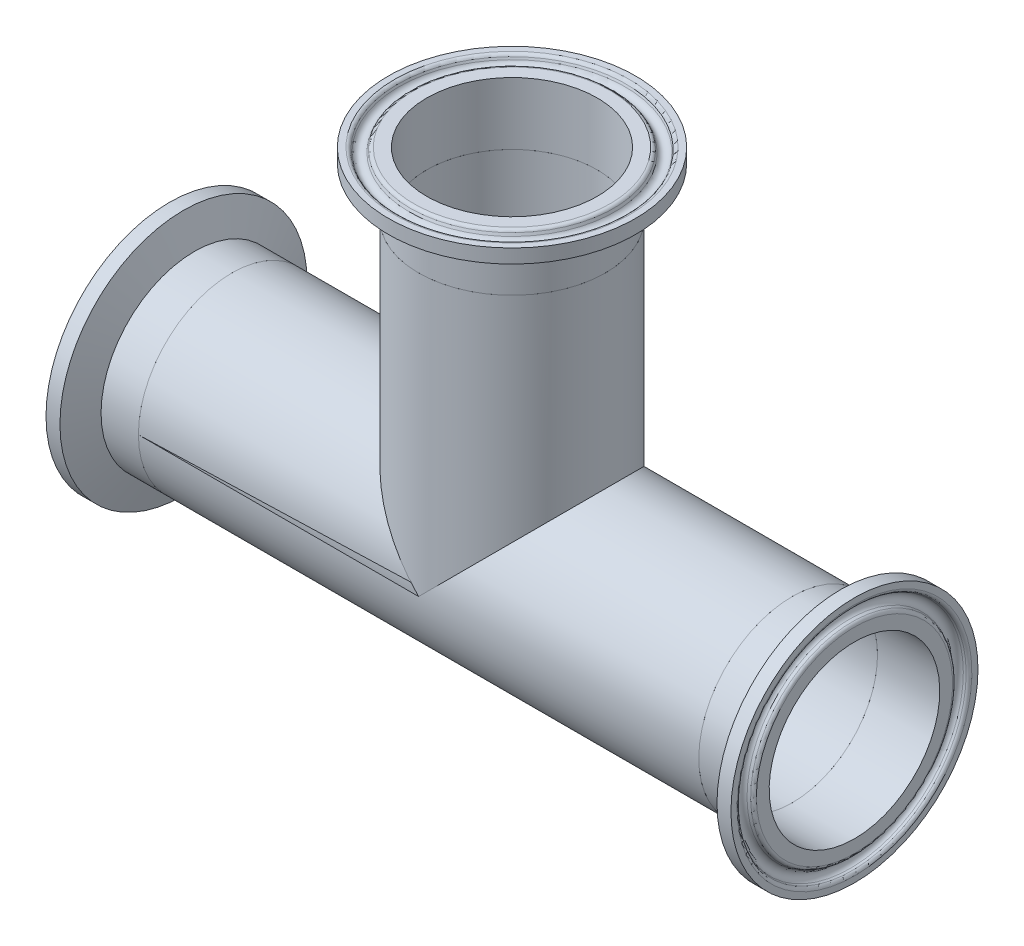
ISO-10303-21;
HEADER;
FILE_DESCRIPTION(('STEP AP214'),'2;1');
FILE_NAME('part.step','',(''),(''),'','','');
FILE_SCHEMA(('AUTOMOTIVE_DESIGN { 1 0 10303 214 1 1 1 1 }'));
ENDSEC;
DATA;
#1=APPLICATION_CONTEXT('core data for automotive mechanical design processes');
#2=APPLICATION_PROTOCOL_DEFINITION('international standard','automotive_design',2000,#1);
#3=PRODUCT_CONTEXT('',#1,'mechanical');
#4=PRODUCT('Part','Part','',(#3));
#5=PRODUCT_RELATED_PRODUCT_CATEGORY('part','',(#4));
#6=PRODUCT_DEFINITION_FORMATION('','',#4);
#7=PRODUCT_DEFINITION_CONTEXT('part definition',#1,'design');
#8=PRODUCT_DEFINITION('design','',#6,#7);
#9=PRODUCT_DEFINITION_SHAPE('','',#8);
#10=(LENGTH_UNIT() NAMED_UNIT(*) SI_UNIT(.MILLI.,.METRE.));
#11=(NAMED_UNIT(*) PLANE_ANGLE_UNIT() SI_UNIT($,.RADIAN.));
#12=(NAMED_UNIT(*) SI_UNIT($,.STERADIAN.) SOLID_ANGLE_UNIT());
#13=UNCERTAINTY_MEASURE_WITH_UNIT(LENGTH_MEASURE(1.E-05),#10,'distance_accuracy_value','');
#14=(GEOMETRIC_REPRESENTATION_CONTEXT(3) GLOBAL_UNCERTAINTY_ASSIGNED_CONTEXT((#13)) GLOBAL_UNIT_ASSIGNED_CONTEXT((#10,
#11,#12)) REPRESENTATION_CONTEXT('',''));
#15=CARTESIAN_POINT('',(0.,0.,0.));
#16=DIRECTION('',(0.,0.,1.));
#17=DIRECTION('',(1.,0.,0.));
#18=AXIS2_PLACEMENT_3D('',#15,#16,#17);
#19=CARTESIAN_POINT('',(56.5172049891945,119.74462668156,86.3832546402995));
#20=DIRECTION('',(0.,-1.00000000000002,0.));
#21=DIRECTION('',(0.552443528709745,0.,0.833550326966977));
#22=AXIS2_PLACEMENT_3D('',#19,#20,#21);
#23=CONICAL_SURFACE('',#22,20.9336326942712,0.401425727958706);
#24=CARTESIAN_POINT('',(56.5172049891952,120.264362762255,86.3832546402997));
#25=DIRECTION('',(0.,1.00000000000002,0.));
#26=DIRECTION('',(-0.552443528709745,0.,-0.833550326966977));
#27=AXIS2_PLACEMENT_3D('',#24,#25,#26);
#28=CIRCLE('',#27,20.7130178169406);
#29=CARTESIAN_POINT('',(45.0744323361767,120.264362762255,69.117911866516));
#30=VERTEX_POINT('',#29);
#31=EDGE_CURVE('P0_E9',#30,#30,#28,.T.);
#32=ORIENTED_EDGE('',*,*,#31,.F.);
#33=EDGE_LOOP('',(#32));
#34=FACE_BOUND('',#33,.T.);
#35=CARTESIAN_POINT('',(56.5172049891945,119.74462668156,86.3832546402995));
#36=DIRECTION('',(0.,1.00000000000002,0.));
#37=DIRECTION('',(-0.552443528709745,0.,-0.833550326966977));
#38=AXIS2_PLACEMENT_3D('',#35,#36,#37);
#39=CIRCLE('',#38,20.9336326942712);
#40=CARTESIAN_POINT('',(44.9525550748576,119.74462668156,68.9340182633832));
#41=VERTEX_POINT('',#40);
#42=EDGE_CURVE('P0_E54',#41,#41,#39,.T.);
#43=ORIENTED_EDGE('',*,*,#42,.T.);
#44=EDGE_LOOP('',(#43));
#45=FACE_BOUND('',#44,.T.);
#46=ADVANCED_FACE('P0_F14',(#34,#45),#23,.T.);
#47=CARTESIAN_POINT('',(56.5172049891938,119.966625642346,86.3832546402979));
#48=DIRECTION('',(0.,1.00000000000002,0.));
#49=DIRECTION('',(-0.552443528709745,0.,-0.833550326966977));
#50=AXIS2_PLACEMENT_3D('',#47,#48,#49);
#51=TOROIDAL_SURFACE('',#50,20.0115931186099,0.761999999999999);
#52=CARTESIAN_POINT('',(56.5172049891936,120.728625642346,86.3832546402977));
#53=DIRECTION('',(0.,1.00000000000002,0.));
#54=DIRECTION('',(-0.552443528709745,0.,-0.833550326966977));
#55=AXIS2_PLACEMENT_3D('',#52,#53,#54);
#56=CIRCLE('',#55,20.0115931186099);
#57=CARTESIAN_POINT('',(45.4619298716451,120.728625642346,69.7025846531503));
#58=VERTEX_POINT('',#57);
#59=EDGE_CURVE('P0_E20',#58,#58,#56,.T.);
#60=ORIENTED_EDGE('',*,*,#59,.F.);
#61=EDGE_LOOP('',(#60));
#62=FACE_BOUND('',#61,.T.);
#63=ORIENTED_EDGE('',*,*,#31,.T.);
#64=EDGE_LOOP('',(#63));
#65=FACE_BOUND('',#64,.T.);
#66=ADVANCED_FACE('P0_F84',(#62,#65),#51,.T.);
#67=CARTESIAN_POINT('',(56.5172049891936,120.728625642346,86.3832546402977));
#68=DIRECTION('',(0.,-1.00000000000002,0.));
#69=DIRECTION('',(0.552443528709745,0.,0.833550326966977));
#70=AXIS2_PLACEMENT_3D('',#67,#68,#69);
#71=PLANE('',#70);
#72=CARTESIAN_POINT('',(56.5172049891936,120.728625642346,86.3832546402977));
#73=DIRECTION('',(0.,1.00000000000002,0.));
#74=DIRECTION('',(-0.552443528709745,0.,-0.833550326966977));
#75=AXIS2_PLACEMENT_3D('',#72,#73,#74);
#76=CIRCLE('',#75,17.399);
#77=CARTESIAN_POINT('',(46.9052400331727,120.728625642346,71.8803125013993));
#78=VERTEX_POINT('',#77);
#79=EDGE_CURVE('P0_E24',#78,#78,#76,.T.);
#80=ORIENTED_EDGE('',*,*,#79,.F.);
#81=EDGE_LOOP('',(#80));
#82=FACE_BOUND('',#81,.T.);
#83=ORIENTED_EDGE('',*,*,#59,.T.);
#84=EDGE_LOOP('',(#83));
#85=FACE_BOUND('',#84,.T.);
#86=ADVANCED_FACE('P0_F89',(#82,#85),#71,.F.);
#87=CARTESIAN_POINT('',(56.5172049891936,120.728625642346,86.3832546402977));
#88=DIRECTION('',(0.,1.00000000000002,0.));
#89=DIRECTION('',(-0.552443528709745,0.,-0.833550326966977));
#90=AXIS2_PLACEMENT_3D('',#87,#88,#89);
#91=CYLINDRICAL_SURFACE('',#90,17.399);
#92=ORIENTED_EDGE('',*,*,#79,.T.);
#93=EDGE_LOOP('',(#92));
#94=FACE_BOUND('',#93,.T.);
#95=CARTESIAN_POINT('',(56.5172049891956,108.028625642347,86.3832546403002));
#96=DIRECTION('',(0.,1.00000000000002,0.));
#97=DIRECTION('',(-0.552443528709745,0.,-0.833550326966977));
#98=AXIS2_PLACEMENT_3D('',#95,#96,#97);
#99=CIRCLE('',#98,17.399);
#100=CARTESIAN_POINT('',(46.9052400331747,108.028625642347,71.8803125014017));
#101=VERTEX_POINT('',#100);
#102=EDGE_CURVE('P0_E28',#101,#101,#99,.T.);
#103=ORIENTED_EDGE('',*,*,#102,.F.);
#104=EDGE_LOOP('',(#103));
#105=FACE_BOUND('',#104,.T.);
#106=ADVANCED_FACE('P0_F94',(#94,#105),#91,.F.);
#107=CARTESIAN_POINT('',(56.5172049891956,108.028625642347,86.3832546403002));
#108=DIRECTION('',(0.,1.00000000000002,0.));
#109=DIRECTION('',(-0.552443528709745,0.,-0.833550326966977));
#110=AXIS2_PLACEMENT_3D('',#107,#108,#109);
#111=PLANE('',#110);
#112=CARTESIAN_POINT('',(56.5172049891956,108.028625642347,86.3832546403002));
#113=DIRECTION('',(0.,1.00000000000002,0.));
#114=DIRECTION('',(-0.552443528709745,0.,-0.833550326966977));
#115=AXIS2_PLACEMENT_3D('',#112,#113,#114);
#116=CIRCLE('',#115,19.05);
#117=CARTESIAN_POINT('',(45.9931557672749,108.028625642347,70.5041209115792));
#118=VERTEX_POINT('',#117);
#119=EDGE_CURVE('P0_E33',#118,#118,#116,.T.);
#120=ORIENTED_EDGE('',*,*,#119,.F.);
#121=EDGE_LOOP('',(#120));
#122=FACE_BOUND('',#121,.T.);
#123=ORIENTED_EDGE('',*,*,#102,.T.);
#124=EDGE_LOOP('',(#123));
#125=FACE_BOUND('',#124,.T.);
#126=ADVANCED_FACE('P0_F100',(#122,#125),#111,.F.);
#127=CARTESIAN_POINT('',(56.5172049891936,120.728625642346,86.3832546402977));
#128=DIRECTION('',(0.,1.00000000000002,0.));
#129=DIRECTION('',(-0.552443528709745,0.,-0.833550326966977));
#130=AXIS2_PLACEMENT_3D('',#127,#128,#129);
#131=CYLINDRICAL_SURFACE('',#130,19.05);
#132=CARTESIAN_POINT('',(56.5172049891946,115.646573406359,86.3832546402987));
#133=DIRECTION('',(0.,1.00000000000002,0.));
#134=DIRECTION('',(-0.552443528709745,0.,-0.833550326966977));
#135=AXIS2_PLACEMENT_3D('',#132,#133,#134);
#136=CIRCLE('',#135,19.05);
#137=CARTESIAN_POINT('',(45.993155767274,115.646573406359,70.5041209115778));
#138=VERTEX_POINT('',#137);
#139=EDGE_CURVE('P0_E36',#138,#138,#136,.T.);
#140=ORIENTED_EDGE('',*,*,#139,.F.);
#141=EDGE_LOOP('',(#140));
#142=FACE_BOUND('',#141,.T.);
#143=ORIENTED_EDGE('',*,*,#119,.T.);
#144=EDGE_LOOP('',(#143));
#145=FACE_BOUND('',#144,.T.);
#146=ADVANCED_FACE('P0_F104',(#142,#145),#131,.T.);
#147=CARTESIAN_POINT('',(56.5172049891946,115.646573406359,86.3832546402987));
#148=DIRECTION('',(0.,1.00000000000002,0.));
#149=DIRECTION('',(-0.552443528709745,0.,-0.833550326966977));
#150=AXIS2_PLACEMENT_3D('',#147,#148,#149);
#151=CONICAL_SURFACE('',#150,19.05,1.22173047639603);
#152=CARTESIAN_POINT('',(56.5172049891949,117.883825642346,86.3832546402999));
#153=DIRECTION('',(0.,1.00000000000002,0.));
#154=DIRECTION('',(-0.552443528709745,0.,-0.833550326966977));
#155=AXIS2_PLACEMENT_3D('',#152,#153,#154);
#156=CIRCLE('',#155,25.1968);
#157=CARTESIAN_POINT('',(42.5973958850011,117.883825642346,65.3804537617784));
#158=VERTEX_POINT('',#157);
#159=EDGE_CURVE('P0_E39',#158,#158,#156,.T.);
#160=ORIENTED_EDGE('',*,*,#159,.F.);
#161=EDGE_LOOP('',(#160));
#162=FACE_BOUND('',#161,.T.);
#163=ORIENTED_EDGE('',*,*,#139,.T.);
#164=EDGE_LOOP('',(#163));
#165=FACE_BOUND('',#164,.T.);
#166=ADVANCED_FACE('P0_F108',(#162,#165),#151,.T.);
#167=CARTESIAN_POINT('',(56.5172049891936,120.728625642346,86.3832546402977));
#168=DIRECTION('',(0.,1.00000000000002,0.));
#169=DIRECTION('',(-0.552443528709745,0.,-0.833550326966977));
#170=AXIS2_PLACEMENT_3D('',#167,#168,#169);
#171=CYLINDRICAL_SURFACE('',#170,25.1968);
#172=CARTESIAN_POINT('',(56.5172049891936,120.728625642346,86.3832546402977));
#173=DIRECTION('',(0.,1.00000000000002,0.));
#174=DIRECTION('',(-0.552443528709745,0.,-0.833550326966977));
#175=AXIS2_PLACEMENT_3D('',#172,#173,#174);
#176=CIRCLE('',#175,25.1968);
#177=CARTESIAN_POINT('',(42.5973958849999,120.728625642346,65.3804537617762));
#178=VERTEX_POINT('',#177);
#179=EDGE_CURVE('P0_E42',#178,#178,#176,.T.);
#180=ORIENTED_EDGE('',*,*,#179,.F.);
#181=EDGE_LOOP('',(#180));
#182=FACE_BOUND('',#181,.T.);
#183=ORIENTED_EDGE('',*,*,#159,.T.);
#184=EDGE_LOOP('',(#183));
#185=FACE_BOUND('',#184,.T.);
#186=ADVANCED_FACE('P0_F80',(#182,#185),#171,.T.);
#187=CARTESIAN_POINT('',(56.5172049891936,120.728625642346,86.3832546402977));
#188=DIRECTION('',(0.,-1.00000000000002,0.));
#189=DIRECTION('',(0.552443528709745,0.,0.833550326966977));
#190=AXIS2_PLACEMENT_3D('',#187,#188,#189);
#191=PLANE('',#190);
#192=CARTESIAN_POINT('',(56.5172049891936,120.728625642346,86.3832546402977));
#193=DIRECTION('',(0.,1.00000000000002,0.));
#194=DIRECTION('',(-0.552443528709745,0.,-0.833550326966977));
#195=AXIS2_PLACEMENT_3D('',#192,#193,#194);
#196=CIRCLE('',#195,23.9521599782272);
#197=CARTESIAN_POINT('',(43.2849892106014,120.728625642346,66.417923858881));
#198=VERTEX_POINT('',#197);
#199=EDGE_CURVE('P0_E45',#198,#198,#196,.T.);
#200=ORIENTED_EDGE('',*,*,#199,.F.);
#201=EDGE_LOOP('',(#200));
#202=FACE_BOUND('',#201,.T.);
#203=ORIENTED_EDGE('',*,*,#179,.T.);
#204=EDGE_LOOP('',(#203));
#205=FACE_BOUND('',#204,.T.);
#206=ADVANCED_FACE('P0_F73',(#202,#205),#191,.F.);
#207=CARTESIAN_POINT('',(56.5172049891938,119.966625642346,86.3832546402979));
#208=DIRECTION('',(0.,1.00000000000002,0.));
#209=DIRECTION('',(-0.552443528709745,0.,-0.833550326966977));
#210=AXIS2_PLACEMENT_3D('',#207,#208,#209);
#211=TOROIDAL_SURFACE('',#210,23.9521599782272,0.761999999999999);
#212=ORIENTED_EDGE('',*,*,#199,.T.);
#213=EDGE_LOOP('',(#212));
#214=FACE_BOUND('',#213,.T.);
#215=CARTESIAN_POINT('',(56.5172049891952,120.264362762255,86.3832546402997));
#216=DIRECTION('',(0.,1.00000000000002,0.));
#217=DIRECTION('',(-0.552443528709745,0.,-0.833550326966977));
#218=AXIS2_PLACEMENT_3D('',#215,#216,#217);
#219=CIRCLE('',#218,23.2507352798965);
#220=CARTESIAN_POINT('',(43.672486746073,120.264362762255,67.0025966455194));
#221=VERTEX_POINT('',#220);
#222=EDGE_CURVE('P0_E48',#221,#221,#219,.T.);
#223=ORIENTED_EDGE('',*,*,#222,.F.);
#224=EDGE_LOOP('',(#223));
#225=FACE_BOUND('',#224,.T.);
#226=ADVANCED_FACE('P0_F68',(#214,#225),#211,.T.);
#227=CARTESIAN_POINT('',(56.5172049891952,120.264362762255,86.3832546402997));
#228=DIRECTION('',(0.,1.00000000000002,0.));
#229=DIRECTION('',(-0.552443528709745,0.,-0.833550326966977));
#230=AXIS2_PLACEMENT_3D('',#227,#228,#229);
#231=CONICAL_SURFACE('',#230,23.2507352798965,0.401425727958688);
#232=CARTESIAN_POINT('',(56.5172049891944,119.855770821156,86.3832546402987));
#233=DIRECTION('',(0.,1.00000000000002,0.));
#234=DIRECTION('',(-0.552443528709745,0.,-0.833550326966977));
#235=AXIS2_PLACEMENT_3D('',#232,#233,#234);
#236=CIRCLE('',#235,23.0772982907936);
#237=CARTESIAN_POINT('',(43.768300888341,119.855770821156,67.1471651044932));
#238=VERTEX_POINT('',#237);
#239=EDGE_CURVE('P0_E51',#238,#238,#236,.T.);
#240=ORIENTED_EDGE('',*,*,#239,.F.);
#241=EDGE_LOOP('',(#240));
#242=FACE_BOUND('',#241,.T.);
#243=ORIENTED_EDGE('',*,*,#222,.T.);
#244=EDGE_LOOP('',(#243));
#245=FACE_BOUND('',#244,.T.);
#246=ADVANCED_FACE('P0_F62',(#242,#245),#231,.F.);
#247=CARTESIAN_POINT('',(56.5172049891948,120.322225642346,86.3832546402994));
#248=DIRECTION('',(0.,1.00000000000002,0.));
#249=DIRECTION('',(-0.552443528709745,0.,-0.833550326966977));
#250=AXIS2_PLACEMENT_3D('',#247,#248,#249);
#251=TOROIDAL_SURFACE('',#250,21.9783995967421,1.1938);
#252=ORIENTED_EDGE('',*,*,#42,.F.);
#253=EDGE_LOOP('',(#252));
#254=FACE_BOUND('',#253,.T.);
#255=ORIENTED_EDGE('',*,*,#239,.T.);
#256=EDGE_LOOP('',(#255));
#257=FACE_BOUND('',#256,.T.);
#258=ADVANCED_FACE('P0_F59',(#254,#257),#251,.F.);
#259=CLOSED_SHELL('',(#46,#66,#86,#106,#126,#146,#166,#186,#206,#226,#246,#258));
#260=MANIFOLD_SOLID_BREP('P0_B1',#259);
#261=CARTESIAN_POINT('',(125.383206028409,50.8786256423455,86.3832546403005));
#262=DIRECTION('',(-1.00000000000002,0.,0.));
#263=DIRECTION('',(0.,0.736652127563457,-0.676271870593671));
#264=AXIS2_PLACEMENT_3D('',#261,#262,#263);
#265=CONICAL_SURFACE('',#264,20.9336326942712,0.401425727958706);
#266=CARTESIAN_POINT('',(125.902942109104,50.8786256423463,86.3832546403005));
#267=DIRECTION('',(1.00000000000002,0.,0.));
#268=DIRECTION('',(0.,-0.736652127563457,0.676271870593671));
#269=AXIS2_PLACEMENT_3D('',#266,#267,#268);
#270=CIRCLE('',#269,20.7130178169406);
#271=CARTESIAN_POINT('',(125.902942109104,35.6203369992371,100.390885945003));
#272=VERTEX_POINT('',#271);
#273=EDGE_CURVE('P1_E10',#272,#272,#270,.T.);
#274=ORIENTED_EDGE('',*,*,#273,.F.);
#275=EDGE_LOOP('',(#274));
#276=FACE_BOUND('',#275,.T.);
#277=CARTESIAN_POINT('',(125.383206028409,50.8786256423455,86.3832546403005));
#278=DIRECTION('',(1.00000000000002,0.,0.));
#279=DIRECTION('',(0.,-0.736652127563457,0.676271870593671));
#280=AXIS2_PLACEMENT_3D('',#277,#278,#279);
#281=CIRCLE('',#280,20.9336326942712);
#282=CARTESIAN_POINT('',(125.383206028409,35.4578205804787,100.540081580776));
#283=VERTEX_POINT('',#282);
#284=EDGE_CURVE('P1_E55',#283,#283,#281,.T.);
#285=ORIENTED_EDGE('',*,*,#284,.T.);
#286=EDGE_LOOP('',(#285));
#287=FACE_BOUND('',#286,.T.);
#288=ADVANCED_FACE('P1_F15',(#276,#287),#265,.T.);
#289=CARTESIAN_POINT('',(125.605204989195,50.8786256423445,86.3832546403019));
#290=DIRECTION('',(1.00000000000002,0.,0.));
#291=DIRECTION('',(0.,-0.736652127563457,0.676271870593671));
#292=AXIS2_PLACEMENT_3D('',#289,#290,#291);
#293=TOROIDAL_SURFACE('',#292,20.0115931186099,0.761999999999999);
#294=CARTESIAN_POINT('',(126.367204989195,50.8786256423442,86.3832546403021));
#295=DIRECTION('',(1.00000000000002,0.,0.));
#296=DIRECTION('',(0.,-0.736652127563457,0.676271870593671));
#297=AXIS2_PLACEMENT_3D('',#294,#295,#296);
#298=CIRCLE('',#297,20.0115931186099);
#299=CARTESIAN_POINT('',(126.367204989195,36.137042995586,99.9165321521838));
#300=VERTEX_POINT('',#299);
#301=EDGE_CURVE('P1_E21',#300,#300,#298,.T.);
#302=ORIENTED_EDGE('',*,*,#301,.F.);
#303=EDGE_LOOP('',(#302));
#304=FACE_BOUND('',#303,.T.);
#305=ORIENTED_EDGE('',*,*,#273,.T.);
#306=EDGE_LOOP('',(#305));
#307=FACE_BOUND('',#306,.T.);
#308=ADVANCED_FACE('P1_F85',(#304,#307),#293,.T.);
#309=CARTESIAN_POINT('',(126.367204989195,50.8786256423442,86.3832546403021));
#310=DIRECTION('',(-1.00000000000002,0.,0.));
#311=DIRECTION('',(0.,0.736652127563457,-0.676271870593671));
#312=AXIS2_PLACEMENT_3D('',#309,#310,#311);
#313=PLANE('',#312);
#314=CARTESIAN_POINT('',(126.367204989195,50.8786256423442,86.3832546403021));
#315=DIRECTION('',(1.00000000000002,0.,0.));
#316=DIRECTION('',(0.,-0.736652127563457,0.676271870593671));
#317=AXIS2_PLACEMENT_3D('',#314,#315,#316);
#318=CIRCLE('',#317,17.399);
#319=CARTESIAN_POINT('',(126.367204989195,38.0616152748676,98.1497089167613));
#320=VERTEX_POINT('',#319);
#321=EDGE_CURVE('P1_E25',#320,#320,#318,.T.);
#322=ORIENTED_EDGE('',*,*,#321,.F.);
#323=EDGE_LOOP('',(#322));
#324=FACE_BOUND('',#323,.T.);
#325=ORIENTED_EDGE('',*,*,#301,.T.);
#326=EDGE_LOOP('',(#325));
#327=FACE_BOUND('',#326,.T.);
#328=ADVANCED_FACE('P1_F90',(#324,#327),#313,.F.);
#329=CARTESIAN_POINT('',(126.367204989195,50.8786256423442,86.3832546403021));
#330=DIRECTION('',(1.00000000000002,0.,0.));
#331=DIRECTION('',(0.,-0.736652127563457,0.676271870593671));
#332=AXIS2_PLACEMENT_3D('',#329,#330,#331);
#333=CYLINDRICAL_SURFACE('',#332,17.399);
#334=ORIENTED_EDGE('',*,*,#321,.T.);
#335=EDGE_LOOP('',(#334));
#336=FACE_BOUND('',#335,.T.);
#337=CARTESIAN_POINT('',(113.667204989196,50.8786256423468,86.3832546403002));
#338=DIRECTION('',(1.00000000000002,0.,0.));
#339=DIRECTION('',(0.,-0.736652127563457,0.676271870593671));
#340=AXIS2_PLACEMENT_3D('',#337,#338,#339);
#341=CIRCLE('',#340,17.399);
#342=CARTESIAN_POINT('',(113.667204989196,38.0616152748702,98.1497089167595));
#343=VERTEX_POINT('',#342);
#344=EDGE_CURVE('P1_E29',#343,#343,#341,.T.);
#345=ORIENTED_EDGE('',*,*,#344,.F.);
#346=EDGE_LOOP('',(#345));
#347=FACE_BOUND('',#346,.T.);
#348=ADVANCED_FACE('P1_F95',(#336,#347),#333,.F.);
#349=CARTESIAN_POINT('',(113.667204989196,50.8786256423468,86.3832546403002));
#350=DIRECTION('',(1.00000000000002,0.,0.));
#351=DIRECTION('',(0.,-0.736652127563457,0.676271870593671));
#352=AXIS2_PLACEMENT_3D('',#349,#350,#351);
#353=PLANE('',#352);
#354=CARTESIAN_POINT('',(113.667204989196,50.8786256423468,86.3832546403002));
#355=DIRECTION('',(1.00000000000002,0.,0.));
#356=DIRECTION('',(0.,-0.736652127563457,0.676271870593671));
#357=AXIS2_PLACEMENT_3D('',#354,#355,#356);
#358=CIRCLE('',#357,19.05);
#359=CARTESIAN_POINT('',(113.667204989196,36.8454026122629,99.2662337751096));
#360=VERTEX_POINT('',#359);
#361=EDGE_CURVE('P1_E34',#360,#360,#358,.T.);
#362=ORIENTED_EDGE('',*,*,#361,.F.);
#363=EDGE_LOOP('',(#362));
#364=FACE_BOUND('',#363,.T.);
#365=ORIENTED_EDGE('',*,*,#344,.T.);
#366=EDGE_LOOP('',(#365));
#367=FACE_BOUND('',#366,.T.);
#368=ADVANCED_FACE('P1_F101',(#364,#367),#353,.F.);
#369=CARTESIAN_POINT('',(126.367204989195,50.8786256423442,86.3832546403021));
#370=DIRECTION('',(1.00000000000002,0.,0.));
#371=DIRECTION('',(0.,-0.736652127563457,0.676271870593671));
#372=AXIS2_PLACEMENT_3D('',#369,#370,#371);
#373=CYLINDRICAL_SURFACE('',#372,19.05);
#374=CARTESIAN_POINT('',(121.285152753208,50.8786256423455,86.3832546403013));
#375=DIRECTION('',(1.00000000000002,0.,0.));
#376=DIRECTION('',(0.,-0.736652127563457,0.676271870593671));
#377=AXIS2_PLACEMENT_3D('',#374,#375,#376);
#378=CIRCLE('',#377,19.05);
#379=CARTESIAN_POINT('',(121.285152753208,36.8454026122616,99.2662337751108));
#380=VERTEX_POINT('',#379);
#381=EDGE_CURVE('P1_E37',#380,#380,#378,.T.);
#382=ORIENTED_EDGE('',*,*,#381,.F.);
#383=EDGE_LOOP('',(#382));
#384=FACE_BOUND('',#383,.T.);
#385=ORIENTED_EDGE('',*,*,#361,.T.);
#386=EDGE_LOOP('',(#385));
#387=FACE_BOUND('',#386,.T.);
#388=ADVANCED_FACE('P1_F105',(#384,#387),#373,.T.);
#389=CARTESIAN_POINT('',(121.285152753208,50.8786256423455,86.3832546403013));
#390=DIRECTION('',(1.00000000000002,0.,0.));
#391=DIRECTION('',(0.,-0.736652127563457,0.676271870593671));
#392=AXIS2_PLACEMENT_3D('',#389,#390,#391);
#393=CONICAL_SURFACE('',#392,19.05,1.22173047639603);
#394=CARTESIAN_POINT('',(123.522404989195,50.878625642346,86.3832546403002));
#395=DIRECTION('',(1.00000000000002,0.,0.));
#396=DIRECTION('',(0.,-0.736652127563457,0.676271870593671));
#397=AXIS2_PLACEMENT_3D('',#394,#395,#396);
#398=CIRCLE('',#397,25.1968);
#399=CARTESIAN_POINT('',(123.522404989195,32.3173493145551,103.423141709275));
#400=VERTEX_POINT('',#399);
#401=EDGE_CURVE('P1_E40',#400,#400,#398,.T.);
#402=ORIENTED_EDGE('',*,*,#401,.F.);
#403=EDGE_LOOP('',(#402));
#404=FACE_BOUND('',#403,.T.);
#405=ORIENTED_EDGE('',*,*,#381,.T.);
#406=EDGE_LOOP('',(#405));
#407=FACE_BOUND('',#406,.T.);
#408=ADVANCED_FACE('P1_F109',(#404,#407),#393,.T.);
#409=CARTESIAN_POINT('',(126.367204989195,50.8786256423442,86.3832546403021));
#410=DIRECTION('',(1.00000000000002,0.,0.));
#411=DIRECTION('',(0.,-0.736652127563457,0.676271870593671));
#412=AXIS2_PLACEMENT_3D('',#409,#410,#411);
#413=CYLINDRICAL_SURFACE('',#412,25.1968);
#414=CARTESIAN_POINT('',(126.367204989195,50.8786256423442,86.3832546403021));
#415=DIRECTION('',(1.00000000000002,0.,0.));
#416=DIRECTION('',(0.,-0.736652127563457,0.676271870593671));
#417=AXIS2_PLACEMENT_3D('',#414,#415,#416);
#418=CIRCLE('',#417,25.1968);
#419=CARTESIAN_POINT('',(126.367204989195,32.3173493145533,103.423141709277));
#420=VERTEX_POINT('',#419);
#421=EDGE_CURVE('P1_E43',#420,#420,#418,.T.);
#422=ORIENTED_EDGE('',*,*,#421,.F.);
#423=EDGE_LOOP('',(#422));
#424=FACE_BOUND('',#423,.T.);
#425=ORIENTED_EDGE('',*,*,#401,.T.);
#426=EDGE_LOOP('',(#425));
#427=FACE_BOUND('',#426,.T.);
#428=ADVANCED_FACE('P1_F81',(#424,#427),#413,.T.);
#429=CARTESIAN_POINT('',(126.367204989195,50.8786256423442,86.3832546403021));
#430=DIRECTION('',(-1.00000000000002,0.,0.));
#431=DIRECTION('',(0.,0.736652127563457,-0.676271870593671));
#432=AXIS2_PLACEMENT_3D('',#429,#430,#431);
#433=PLANE('',#432);
#434=CARTESIAN_POINT('',(126.367204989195,50.8786256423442,86.3832546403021));
#435=DIRECTION('',(1.00000000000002,0.,0.));
#436=DIRECTION('',(0.,-0.736652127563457,0.676271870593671));
#437=AXIS2_PLACEMENT_3D('',#434,#435,#436);
#438=CIRCLE('',#437,23.9521599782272);
#439=CARTESIAN_POINT('',(126.367204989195,33.2342160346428,102.581426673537));
#440=VERTEX_POINT('',#439);
#441=EDGE_CURVE('P1_E46',#440,#440,#438,.T.);
#442=ORIENTED_EDGE('',*,*,#441,.F.);
#443=EDGE_LOOP('',(#442));
#444=FACE_BOUND('',#443,.T.);
#445=ORIENTED_EDGE('',*,*,#421,.T.);
#446=EDGE_LOOP('',(#445));
#447=FACE_BOUND('',#446,.T.);
#448=ADVANCED_FACE('P1_F74',(#444,#447),#433,.F.);
#449=CARTESIAN_POINT('',(125.605204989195,50.8786256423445,86.3832546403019));
#450=DIRECTION('',(1.00000000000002,0.,0.));
#451=DIRECTION('',(0.,-0.736652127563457,0.676271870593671));
#452=AXIS2_PLACEMENT_3D('',#449,#450,#451);
#453=TOROIDAL_SURFACE('',#452,23.9521599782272,0.761999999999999);
#454=ORIENTED_EDGE('',*,*,#441,.T.);
#455=EDGE_LOOP('',(#454));
#456=FACE_BOUND('',#455,.T.);
#457=CARTESIAN_POINT('',(125.902942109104,50.8786256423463,86.3832546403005));
#458=DIRECTION('',(1.00000000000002,0.,0.));
#459=DIRECTION('',(0.,-0.736652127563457,0.676271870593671));
#460=AXIS2_PLACEMENT_3D('',#457,#458,#459);
#461=CIRCLE('',#460,23.2507352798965);
#462=CARTESIAN_POINT('',(125.902942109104,33.7509220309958,102.107072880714));
#463=VERTEX_POINT('',#462);
#464=EDGE_CURVE('P1_E49',#463,#463,#461,.T.);
#465=ORIENTED_EDGE('',*,*,#464,.F.);
#466=EDGE_LOOP('',(#465));
#467=FACE_BOUND('',#466,.T.);
#468=ADVANCED_FACE('P1_F69',(#456,#467),#453,.T.);
#469=CARTESIAN_POINT('',(125.902942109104,50.8786256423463,86.3832546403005));
#470=DIRECTION('',(1.00000000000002,0.,0.));
#471=DIRECTION('',(0.,-0.736652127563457,0.676271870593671));
#472=AXIS2_PLACEMENT_3D('',#469,#470,#471);
#473=CONICAL_SURFACE('',#472,23.2507352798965,0.401425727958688);
#474=CARTESIAN_POINT('',(125.494350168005,50.8786256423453,86.3832546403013));
#475=DIRECTION('',(1.00000000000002,0.,0.));
#476=DIRECTION('',(0.,-0.736652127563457,0.676271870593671));
#477=AXIS2_PLACEMENT_3D('',#474,#475,#476);
#478=CIRCLE('',#477,23.0772982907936);
#479=CARTESIAN_POINT('',(125.494350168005,33.8786847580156,101.989782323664));
#480=VERTEX_POINT('',#479);
#481=EDGE_CURVE('P1_E52',#480,#480,#478,.T.);
#482=ORIENTED_EDGE('',*,*,#481,.F.);
#483=EDGE_LOOP('',(#482));
#484=FACE_BOUND('',#483,.T.);
#485=ORIENTED_EDGE('',*,*,#464,.T.);
#486=EDGE_LOOP('',(#485));
#487=FACE_BOUND('',#486,.T.);
#488=ADVANCED_FACE('P1_F63',(#484,#487),#473,.F.);
#489=CARTESIAN_POINT('',(125.960804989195,50.8786256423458,86.3832546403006));
#490=DIRECTION('',(1.00000000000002,0.,0.));
#491=DIRECTION('',(0.,-0.736652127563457,0.676271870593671));
#492=AXIS2_PLACEMENT_3D('',#489,#490,#491);
#493=TOROIDAL_SURFACE('',#492,21.9783995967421,1.1938);
#494=ORIENTED_EDGE('',*,*,#284,.F.);
#495=EDGE_LOOP('',(#494));
#496=FACE_BOUND('',#495,.T.);
#497=ORIENTED_EDGE('',*,*,#481,.T.);
#498=EDGE_LOOP('',(#497));
#499=FACE_BOUND('',#498,.T.);
#500=ADVANCED_FACE('P1_F60',(#496,#499),#493,.F.);
#501=CLOSED_SHELL('',(#288,#308,#328,#348,#368,#388,#408,#428,#448,#468,#488,#500));
#502=MANIFOLD_SOLID_BREP('P1_B1',#501);
#503=CARTESIAN_POINT('',(-12.3487960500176,50.8786256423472,86.383254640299));
#504=DIRECTION('',(1.00000000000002,0.,0.));
#505=DIRECTION('',(0.,-0.745531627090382,0.666470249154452));
#506=AXIS2_PLACEMENT_3D('',#503,#504,#505);
#507=CONICAL_SURFACE('',#506,20.9336326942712,0.401425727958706);
#508=CARTESIAN_POINT('',(-12.8685321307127,50.8786256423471,86.3832546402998));
#509=DIRECTION('',(-1.00000000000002,0.,0.));
#510=DIRECTION('',(0.,0.745531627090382,-0.666470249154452));
#511=AXIS2_PLACEMENT_3D('',#508,#509,#510);
#512=CIRCLE('',#511,20.7130178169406);
#513=CARTESIAN_POINT('',(-12.8685321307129,66.320835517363,72.5786444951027));
#514=VERTEX_POINT('',#513);
#515=EDGE_CURVE('P2_E10',#514,#514,#512,.T.);
#516=ORIENTED_EDGE('',*,*,#515,.F.);
#517=EDGE_LOOP('',(#516));
#518=FACE_BOUND('',#517,.T.);
#519=CARTESIAN_POINT('',(-12.3487960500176,50.8786256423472,86.383254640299));
#520=DIRECTION('',(-1.00000000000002,0.,0.));
#521=DIRECTION('',(0.,0.745531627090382,-0.666470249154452));
#522=AXIS2_PLACEMENT_3D('',#519,#520,#521);
#523=CIRCLE('',#522,20.9336326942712);
#524=CARTESIAN_POINT('',(-12.3487960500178,66.4853108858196,72.4316112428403));
#525=VERTEX_POINT('',#524);
#526=EDGE_CURVE('P2_E55',#525,#525,#523,.T.);
#527=ORIENTED_EDGE('',*,*,#526,.T.);
#528=EDGE_LOOP('',(#527));
#529=FACE_BOUND('',#528,.T.);
#530=ADVANCED_FACE('P2_F15',(#518,#529),#507,.T.);
#531=CARTESIAN_POINT('',(-12.5707950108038,50.8786256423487,86.3832546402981));
#532=DIRECTION('',(-1.00000000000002,0.,0.));
#533=DIRECTION('',(0.,0.745531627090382,-0.666470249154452));
#534=AXIS2_PLACEMENT_3D('',#531,#532,#533);
#535=TOROIDAL_SURFACE('',#534,20.0115931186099,0.761999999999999);
#536=CARTESIAN_POINT('',(-13.3327950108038,50.8786256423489,86.3832546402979));
#537=DIRECTION('',(-1.00000000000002,0.,0.));
#538=DIRECTION('',(0.,0.745531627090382,-0.666470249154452));
#539=AXIS2_PLACEMENT_3D('',#536,#537,#538);
#540=CIRCLE('',#539,20.0115931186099);
#541=CARTESIAN_POINT('',(-13.332795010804,65.7979012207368,73.0461231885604));
#542=VERTEX_POINT('',#541);
#543=EDGE_CURVE('P2_E21',#542,#542,#540,.T.);
#544=ORIENTED_EDGE('',*,*,#543,.F.);
#545=EDGE_LOOP('',(#544));
#546=FACE_BOUND('',#545,.T.);
#547=ORIENTED_EDGE('',*,*,#515,.T.);
#548=EDGE_LOOP('',(#547));
#549=FACE_BOUND('',#548,.T.);
#550=ADVANCED_FACE('P2_F85',(#546,#549),#535,.T.);
#551=CARTESIAN_POINT('',(-13.3327950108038,50.8786256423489,86.3832546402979));
#552=DIRECTION('',(1.00000000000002,0.,0.));
#553=DIRECTION('',(0.,-0.745531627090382,0.666470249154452));
#554=AXIS2_PLACEMENT_3D('',#551,#552,#553);
#555=PLANE('',#554);
#556=CARTESIAN_POINT('',(-13.3327950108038,50.8786256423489,86.3832546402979));
#557=DIRECTION('',(-1.00000000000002,0.,0.));
#558=DIRECTION('',(0.,0.745531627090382,-0.666470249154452));
#559=AXIS2_PLACEMENT_3D('',#556,#557,#558);
#560=CIRCLE('',#559,17.399);
#561=CARTESIAN_POINT('',(-13.332795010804,63.8501304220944,74.7873387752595));
#562=VERTEX_POINT('',#561);
#563=EDGE_CURVE('P2_E25',#562,#562,#560,.T.);
#564=ORIENTED_EDGE('',*,*,#563,.F.);
#565=EDGE_LOOP('',(#564));
#566=FACE_BOUND('',#565,.T.);
#567=ORIENTED_EDGE('',*,*,#543,.T.);
#568=EDGE_LOOP('',(#567));
#569=FACE_BOUND('',#568,.T.);
#570=ADVANCED_FACE('P2_F90',(#566,#569),#555,.F.);
#571=CARTESIAN_POINT('',(-13.3327950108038,50.8786256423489,86.3832546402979));
#572=DIRECTION('',(-1.00000000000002,0.,0.));
#573=DIRECTION('',(0.,0.745531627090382,-0.666470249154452));
#574=AXIS2_PLACEMENT_3D('',#571,#572,#573);
#575=CYLINDRICAL_SURFACE('',#574,17.399);
#576=ORIENTED_EDGE('',*,*,#563,.T.);
#577=EDGE_LOOP('',(#576));
#578=FACE_BOUND('',#577,.T.);
#579=CARTESIAN_POINT('',(-0.632795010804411,50.8786256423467,86.3832546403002));
#580=DIRECTION('',(-1.00000000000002,0.,0.));
#581=DIRECTION('',(0.,0.745531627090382,-0.666470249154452));
#582=AXIS2_PLACEMENT_3D('',#579,#580,#581);
#583=CIRCLE('',#582,17.399);
#584=CARTESIAN_POINT('',(-0.632795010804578,63.8501304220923,74.7873387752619));
#585=VERTEX_POINT('',#584);
#586=EDGE_CURVE('P2_E29',#585,#585,#583,.T.);
#587=ORIENTED_EDGE('',*,*,#586,.F.);
#588=EDGE_LOOP('',(#587));
#589=FACE_BOUND('',#588,.T.);
#590=ADVANCED_FACE('P2_F95',(#578,#589),#575,.F.);
#591=CARTESIAN_POINT('',(-0.632795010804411,50.8786256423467,86.3832546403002));
#592=DIRECTION('',(-1.00000000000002,0.,0.));
#593=DIRECTION('',(0.,0.745531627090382,-0.666470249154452));
#594=AXIS2_PLACEMENT_3D('',#591,#592,#593);
#595=PLANE('',#594);
#596=CARTESIAN_POINT('',(-0.632795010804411,50.8786256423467,86.3832546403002));
#597=DIRECTION('',(-1.00000000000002,0.,0.));
#598=DIRECTION('',(0.,0.745531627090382,-0.666470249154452));
#599=AXIS2_PLACEMENT_3D('',#596,#597,#598);
#600=CIRCLE('',#599,19.05);
#601=CARTESIAN_POINT('',(-0.632795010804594,65.0810031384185,73.6869963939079));
#602=VERTEX_POINT('',#601);
#603=EDGE_CURVE('P2_E34',#602,#602,#600,.T.);
#604=ORIENTED_EDGE('',*,*,#603,.F.);
#605=EDGE_LOOP('',(#604));
#606=FACE_BOUND('',#605,.T.);
#607=ORIENTED_EDGE('',*,*,#586,.T.);
#608=EDGE_LOOP('',(#607));
#609=FACE_BOUND('',#608,.T.);
#610=ADVANCED_FACE('P2_F101',(#606,#609),#595,.F.);
#611=CARTESIAN_POINT('',(-13.3327950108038,50.8786256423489,86.3832546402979));
#612=DIRECTION('',(-1.00000000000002,0.,0.));
#613=DIRECTION('',(0.,0.745531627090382,-0.666470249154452));
#614=AXIS2_PLACEMENT_3D('',#611,#612,#613);
#615=CYLINDRICAL_SURFACE('',#614,19.05);
#616=CARTESIAN_POINT('',(-8.25074277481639,50.878625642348,86.3832546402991));
#617=DIRECTION('',(-1.00000000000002,0.,0.));
#618=DIRECTION('',(0.,0.745531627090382,-0.666470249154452));
#619=AXIS2_PLACEMENT_3D('',#616,#617,#618);
#620=CIRCLE('',#619,19.05);
#621=CARTESIAN_POINT('',(-8.25074277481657,65.0810031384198,73.6869963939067));
#622=VERTEX_POINT('',#621);
#623=EDGE_CURVE('P2_E37',#622,#622,#620,.T.);
#624=ORIENTED_EDGE('',*,*,#623,.F.);
#625=EDGE_LOOP('',(#624));
#626=FACE_BOUND('',#625,.T.);
#627=ORIENTED_EDGE('',*,*,#603,.T.);
#628=EDGE_LOOP('',(#627));
#629=FACE_BOUND('',#628,.T.);
#630=ADVANCED_FACE('P2_F105',(#626,#629),#615,.T.);
#631=CARTESIAN_POINT('',(-8.25074277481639,50.878625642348,86.3832546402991));
#632=DIRECTION('',(-1.00000000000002,0.,0.));
#633=DIRECTION('',(0.,0.745531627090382,-0.666470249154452));
#634=AXIS2_PLACEMENT_3D('',#631,#632,#633);
#635=CONICAL_SURFACE('',#634,19.05,1.22173047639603);
#636=CARTESIAN_POINT('',(-10.4879950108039,50.8786256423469,86.3832546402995));
#637=DIRECTION('',(-1.00000000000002,0.,0.));
#638=DIRECTION('',(0.,0.745531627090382,-0.666470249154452));
#639=AXIS2_PLACEMENT_3D('',#636,#637,#638);
#640=CIRCLE('',#639,25.1968);
#641=CARTESIAN_POINT('',(-10.4879950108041,69.6636369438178,69.5903370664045));
#642=VERTEX_POINT('',#641);
#643=EDGE_CURVE('P2_E40',#642,#642,#640,.T.);
#644=ORIENTED_EDGE('',*,*,#643,.F.);
#645=EDGE_LOOP('',(#644));
#646=FACE_BOUND('',#645,.T.);
#647=ORIENTED_EDGE('',*,*,#623,.T.);
#648=EDGE_LOOP('',(#647));
#649=FACE_BOUND('',#648,.T.);
#650=ADVANCED_FACE('P2_F109',(#646,#649),#635,.T.);
#651=CARTESIAN_POINT('',(-13.3327950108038,50.8786256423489,86.3832546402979));
#652=DIRECTION('',(-1.00000000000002,0.,0.));
#653=DIRECTION('',(0.,0.745531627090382,-0.666470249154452));
#654=AXIS2_PLACEMENT_3D('',#651,#652,#653);
#655=CYLINDRICAL_SURFACE('',#654,25.1968);
#656=CARTESIAN_POINT('',(-13.3327950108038,50.8786256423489,86.3832546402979));
#657=DIRECTION('',(-1.00000000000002,0.,0.));
#658=DIRECTION('',(0.,0.745531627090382,-0.666470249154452));
#659=AXIS2_PLACEMENT_3D('',#656,#657,#658);
#660=CIRCLE('',#659,25.1968);
#661=CARTESIAN_POINT('',(-13.3327950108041,69.6636369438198,69.590337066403));
#662=VERTEX_POINT('',#661);
#663=EDGE_CURVE('P2_E43',#662,#662,#660,.T.);
#664=ORIENTED_EDGE('',*,*,#663,.F.);
#665=EDGE_LOOP('',(#664));
#666=FACE_BOUND('',#665,.T.);
#667=ORIENTED_EDGE('',*,*,#643,.T.);
#668=EDGE_LOOP('',(#667));
#669=FACE_BOUND('',#668,.T.);
#670=ADVANCED_FACE('P2_F81',(#666,#669),#655,.T.);
#671=CARTESIAN_POINT('',(-13.3327950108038,50.8786256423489,86.3832546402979));
#672=DIRECTION('',(1.00000000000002,0.,0.));
#673=DIRECTION('',(0.,-0.745531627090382,0.666470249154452));
#674=AXIS2_PLACEMENT_3D('',#671,#672,#673);
#675=PLANE('',#674);
#676=CARTESIAN_POINT('',(-13.3327950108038,50.8786256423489,86.3832546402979));
#677=DIRECTION('',(-1.00000000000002,0.,0.));
#678=DIRECTION('',(0.,0.745531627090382,-0.666470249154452));
#679=AXIS2_PLACEMENT_3D('',#676,#677,#678);
#680=CIRCLE('',#679,23.9521599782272);
#681=CARTESIAN_POINT('',(-13.3327950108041,68.7357184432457,70.4198526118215));
#682=VERTEX_POINT('',#681);
#683=EDGE_CURVE('P2_E46',#682,#682,#680,.T.);
#684=ORIENTED_EDGE('',*,*,#683,.F.);
#685=EDGE_LOOP('',(#684));
#686=FACE_BOUND('',#685,.T.);
#687=ORIENTED_EDGE('',*,*,#663,.T.);
#688=EDGE_LOOP('',(#687));
#689=FACE_BOUND('',#688,.T.);
#690=ADVANCED_FACE('P2_F74',(#686,#689),#675,.F.);
#691=CARTESIAN_POINT('',(-12.5707950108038,50.8786256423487,86.3832546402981));
#692=DIRECTION('',(-1.00000000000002,0.,0.));
#693=DIRECTION('',(0.,0.745531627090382,-0.666470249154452));
#694=AXIS2_PLACEMENT_3D('',#691,#692,#693);
#695=TOROIDAL_SURFACE('',#694,23.9521599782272,0.761999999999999);
#696=ORIENTED_EDGE('',*,*,#683,.T.);
#697=EDGE_LOOP('',(#696));
#698=FACE_BOUND('',#697,.T.);
#699=CARTESIAN_POINT('',(-12.8685321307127,50.8786256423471,86.3832546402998));
#700=DIRECTION('',(-1.00000000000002,0.,0.));
#701=DIRECTION('',(0.,0.745531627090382,-0.666470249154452));
#702=AXIS2_PLACEMENT_3D('',#699,#700,#701);
#703=CIRCLE('',#702,23.2507352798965);
#704=CARTESIAN_POINT('',(-12.8685321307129,68.2127841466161,70.8873313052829));
#705=VERTEX_POINT('',#704);
#706=EDGE_CURVE('P2_E49',#705,#705,#703,.T.);
#707=ORIENTED_EDGE('',*,*,#706,.F.);
#708=EDGE_LOOP('',(#707));
#709=FACE_BOUND('',#708,.T.);
#710=ADVANCED_FACE('P2_F69',(#698,#709),#695,.T.);
#711=CARTESIAN_POINT('',(-12.8685321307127,50.8786256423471,86.3832546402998));
#712=DIRECTION('',(-1.00000000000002,0.,0.));
#713=DIRECTION('',(0.,0.745531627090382,-0.666470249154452));
#714=AXIS2_PLACEMENT_3D('',#711,#712,#713);
#715=CONICAL_SURFACE('',#714,23.2507352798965,0.401425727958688);
#716=CARTESIAN_POINT('',(-12.4599401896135,50.878625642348,86.3832546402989));
#717=DIRECTION('',(-1.00000000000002,0.,0.));
#718=DIRECTION('',(0.,0.745531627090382,-0.666470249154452));
#719=AXIS2_PLACEMENT_3D('',#716,#717,#718);
#720=CIRCLE('',#719,23.0772982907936);
#721=CARTESIAN_POINT('',(-12.4599401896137,68.0834813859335,71.002921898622));
#722=VERTEX_POINT('',#721);
#723=EDGE_CURVE('P2_E52',#722,#722,#720,.T.);
#724=ORIENTED_EDGE('',*,*,#723,.F.);
#725=EDGE_LOOP('',(#724));
#726=FACE_BOUND('',#725,.T.);
#727=ORIENTED_EDGE('',*,*,#706,.T.);
#728=EDGE_LOOP('',(#727));
#729=FACE_BOUND('',#728,.T.);
#730=ADVANCED_FACE('P2_F63',(#726,#729),#715,.F.);
#731=CARTESIAN_POINT('',(-12.9263950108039,50.8786256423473,86.3832546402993));
#732=DIRECTION('',(-1.00000000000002,0.,0.));
#733=DIRECTION('',(0.,0.745531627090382,-0.666470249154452));
#734=AXIS2_PLACEMENT_3D('',#731,#732,#733);
#735=TOROIDAL_SURFACE('',#734,21.9783995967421,1.1938);
#736=ORIENTED_EDGE('',*,*,#526,.F.);
#737=EDGE_LOOP('',(#736));
#738=FACE_BOUND('',#737,.T.);
#739=ORIENTED_EDGE('',*,*,#723,.T.);
#740=EDGE_LOOP('',(#739));
#741=FACE_BOUND('',#740,.T.);
#742=ADVANCED_FACE('P2_F60',(#738,#741),#735,.F.);
#743=CLOSED_SHELL('',(#530,#550,#570,#590,#610,#630,#650,#670,#690,#710,#730,#742));
#744=MANIFOLD_SOLID_BREP('P2_B1',#743);
#745=CARTESIAN_POINT('',(56.5172049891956,108.028625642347,86.3832546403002));
#746=DIRECTION('',(0.,-1.,0.));
#747=DIRECTION('',(0.,0.,-1.));
#748=AXIS2_PLACEMENT_3D('',#745,#746,#747);
#749=CYLINDRICAL_SURFACE('',#748,19.05);
#750=CARTESIAN_POINT('',(56.5172049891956,108.028625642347,86.3832546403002));
#751=DIRECTION('',(0.,1.,0.));
#752=DIRECTION('',(0.,0.,1.));
#753=AXIS2_PLACEMENT_3D('',#750,#751,#752);
#754=CIRCLE('',#753,19.05);
#755=CARTESIAN_POINT('',(56.5172049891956,108.028625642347,105.4332546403));
#756=VERTEX_POINT('',#755);
#757=EDGE_CURVE('P3_E11',#756,#756,#754,.T.);
#758=ORIENTED_EDGE('',*,*,#757,.F.);
#759=EDGE_LOOP('',(#758));
#760=FACE_BOUND('',#759,.T.);
#761=CARTESIAN_POINT('',(56.5172049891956,50.8786256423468,86.3832546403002));
#762=DIRECTION('',(-0.707106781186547,-0.707106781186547,0.));
#763=DIRECTION('',(0.707106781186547,-0.707106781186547,0.));
#764=AXIS2_PLACEMENT_3D('',#761,#762,#763);
#765=ELLIPSE('',#764,26.9407683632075,19.05);
#766=CARTESIAN_POINT('',(56.5172049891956,50.8786256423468,105.4332546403));
#767=VERTEX_POINT('',#766);
#768=CARTESIAN_POINT('',(56.5172049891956,50.8786256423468,67.3332546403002));
#769=VERTEX_POINT('',#768);
#770=EDGE_CURVE('P3_E24',#767,#769,#765,.T.);
#771=ORIENTED_EDGE('',*,*,#770,.F.);
#772=CARTESIAN_POINT('',(56.5172049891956,50.8786256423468,86.3832546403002));
#773=DIRECTION('',(0.707106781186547,-0.707106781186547,0.));
#774=DIRECTION('',(-0.707106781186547,-0.707106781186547,0.));
#775=AXIS2_PLACEMENT_3D('',#772,#773,#774);
#776=ELLIPSE('',#775,26.9407683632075,19.05);
#777=EDGE_CURVE('P3_E37',#769,#767,#776,.T.);
#778=ORIENTED_EDGE('',*,*,#777,.F.);
#779=EDGE_LOOP('',(#771,#778));
#780=FACE_BOUND('',#779,.T.);
#781=ADVANCED_FACE('P3_F17',(#760,#780),#749,.T.);
#782=CARTESIAN_POINT('',(56.5172049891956,108.028625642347,86.3832546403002));
#783=DIRECTION('',(0.,1.,0.));
#784=DIRECTION('',(0.,0.,1.));
#785=AXIS2_PLACEMENT_3D('',#782,#783,#784);
#786=PLANE('',#785);
#787=CARTESIAN_POINT('',(56.5172049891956,108.028625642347,86.3832546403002));
#788=DIRECTION('',(0.,1.,0.));
#789=DIRECTION('',(0.,0.,1.));
#790=AXIS2_PLACEMENT_3D('',#787,#788,#789);
#791=CIRCLE('',#790,17.399);
#792=CARTESIAN_POINT('',(56.5172049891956,108.028625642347,103.7822546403));
#793=VERTEX_POINT('',#792);
#794=EDGE_CURVE('P3_E49',#793,#793,#791,.T.);
#795=ORIENTED_EDGE('',*,*,#794,.F.);
#796=EDGE_LOOP('',(#795));
#797=FACE_BOUND('',#796,.T.);
#798=ORIENTED_EDGE('',*,*,#757,.T.);
#799=EDGE_LOOP('',(#798));
#800=FACE_BOUND('',#799,.T.);
#801=ADVANCED_FACE('P3_F64',(#797,#800),#786,.T.);
#802=CARTESIAN_POINT('',(113.667204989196,50.8786256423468,86.3832546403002));
#803=DIRECTION('',(-1.,0.,0.));
#804=DIRECTION('',(0.,0.,1.));
#805=AXIS2_PLACEMENT_3D('',#802,#803,#804);
#806=CYLINDRICAL_SURFACE('',#805,19.05);
#807=CARTESIAN_POINT('',(-0.632795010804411,50.8786256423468,86.3832546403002));
#808=DIRECTION('',(1.,0.,0.));
#809=DIRECTION('',(0.,0.,-1.));
#810=AXIS2_PLACEMENT_3D('',#807,#808,#809);
#811=CIRCLE('',#810,19.05);
#812=CARTESIAN_POINT('',(-0.632795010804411,50.8786256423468,67.3332546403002));
#813=VERTEX_POINT('',#812);
#814=EDGE_CURVE('P3_E52',#813,#813,#811,.T.);
#815=ORIENTED_EDGE('',*,*,#814,.T.);
#816=EDGE_LOOP('',(#815));
#817=FACE_BOUND('',#816,.T.);
#818=CARTESIAN_POINT('',(113.667204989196,50.8786256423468,86.3832546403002));
#819=DIRECTION('',(1.,0.,0.));
#820=DIRECTION('',(0.,0.,-1.));
#821=AXIS2_PLACEMENT_3D('',#818,#819,#820);
#822=CIRCLE('',#821,19.05);
#823=CARTESIAN_POINT('',(113.667204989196,50.8786256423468,67.3332546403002));
#824=VERTEX_POINT('',#823);
#825=EDGE_CURVE('P3_E56',#824,#824,#822,.T.);
#826=ORIENTED_EDGE('',*,*,#825,.F.);
#827=EDGE_LOOP('',(#826));
#828=FACE_BOUND('',#827,.T.);
#829=ORIENTED_EDGE('',*,*,#777,.T.);
#830=ORIENTED_EDGE('',*,*,#770,.T.);
#831=EDGE_LOOP('',(#829,#830));
#832=FACE_BOUND('',#831,.T.);
#833=ADVANCED_FACE('P3_F62',(#817,#828,#832),#806,.T.);
#834=CARTESIAN_POINT('',(113.667204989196,50.8786256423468,86.3832546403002));
#835=DIRECTION('',(1.,0.,0.));
#836=DIRECTION('',(0.,0.,-1.));
#837=AXIS2_PLACEMENT_3D('',#834,#835,#836);
#838=PLANE('',#837);
#839=CARTESIAN_POINT('',(113.667204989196,50.8786256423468,86.3832546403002));
#840=DIRECTION('',(1.,0.,0.));
#841=DIRECTION('',(0.,0.,-1.));
#842=AXIS2_PLACEMENT_3D('',#839,#840,#841);
#843=CIRCLE('',#842,17.399);
#844=CARTESIAN_POINT('',(113.667204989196,50.8786256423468,68.9842546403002));
#845=VERTEX_POINT('',#844);
#846=EDGE_CURVE('P3_E97',#845,#845,#843,.T.);
#847=ORIENTED_EDGE('',*,*,#846,.F.);
#848=EDGE_LOOP('',(#847));
#849=FACE_BOUND('',#848,.T.);
#850=ORIENTED_EDGE('',*,*,#825,.T.);
#851=EDGE_LOOP('',(#850));
#852=FACE_BOUND('',#851,.T.);
#853=ADVANCED_FACE('P3_F76',(#849,#852),#838,.T.);
#854=CARTESIAN_POINT('',(-0.632795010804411,50.8786256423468,86.3832546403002));
#855=DIRECTION('',(1.,0.,0.));
#856=DIRECTION('',(0.,0.,-1.));
#857=AXIS2_PLACEMENT_3D('',#854,#855,#856);
#858=PLANE('',#857);
#859=CARTESIAN_POINT('',(-0.632795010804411,50.8786256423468,86.3832546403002));
#860=DIRECTION('',(1.,0.,0.));
#861=DIRECTION('',(0.,0.,-1.));
#862=AXIS2_PLACEMENT_3D('',#859,#860,#861);
#863=CIRCLE('',#862,17.399);
#864=CARTESIAN_POINT('',(-0.632795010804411,50.8786256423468,68.9842546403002));
#865=VERTEX_POINT('',#864);
#866=EDGE_CURVE('P3_E45',#865,#865,#863,.T.);
#867=ORIENTED_EDGE('',*,*,#866,.T.);
#868=EDGE_LOOP('',(#867));
#869=FACE_BOUND('',#868,.T.);
#870=ORIENTED_EDGE('',*,*,#814,.F.);
#871=EDGE_LOOP('',(#870));
#872=FACE_BOUND('',#871,.T.);
#873=ADVANCED_FACE('P3_F81',(#869,#872),#858,.F.);
#874=CARTESIAN_POINT('',(56.5172049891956,50.8786256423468,86.3832546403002));
#875=DIRECTION('',(0.,1.,0.));
#876=DIRECTION('',(0.,0.,1.));
#877=AXIS2_PLACEMENT_3D('',#874,#875,#876);
#878=CYLINDRICAL_SURFACE('',#877,17.399);
#879=CARTESIAN_POINT('',(56.5172049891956,50.8786256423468,86.3832546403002));
#880=DIRECTION('',(-0.707106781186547,0.707106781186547,0.));
#881=DIRECTION('',(0.707106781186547,0.707106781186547,0.));
#882=AXIS2_PLACEMENT_3D('',#879,#880,#881);
#883=ELLIPSE('',#882,24.6059017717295,17.399);
#884=CARTESIAN_POINT('',(56.5172049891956,50.8786256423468,68.9842546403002));
#885=VERTEX_POINT('',#884);
#886=CARTESIAN_POINT('',(56.5172049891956,50.8786256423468,103.7822546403));
#887=VERTEX_POINT('',#886);
#888=EDGE_CURVE('P3_E42',#885,#887,#883,.F.);
#889=ORIENTED_EDGE('',*,*,#888,.T.);
#890=CARTESIAN_POINT('',(56.5172049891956,50.8786256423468,86.3832546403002));
#891=DIRECTION('',(0.707106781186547,0.707106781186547,0.));
#892=DIRECTION('',(-0.707106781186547,0.707106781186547,0.));
#893=AXIS2_PLACEMENT_3D('',#890,#891,#892);
#894=ELLIPSE('',#893,24.6059017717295,17.399);
#895=EDGE_CURVE('P3_E30',#887,#885,#894,.F.);
#896=ORIENTED_EDGE('',*,*,#895,.T.);
#897=EDGE_LOOP('',(#889,#896));
#898=FACE_BOUND('',#897,.T.);
#899=ORIENTED_EDGE('',*,*,#794,.T.);
#900=EDGE_LOOP('',(#899));
#901=FACE_BOUND('',#900,.T.);
#902=ADVANCED_FACE('P3_F47',(#898,#901),#878,.F.);
#903=CARTESIAN_POINT('',(-0.632795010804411,50.8786256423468,86.3832546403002));
#904=DIRECTION('',(1.,0.,0.));
#905=DIRECTION('',(0.,0.,-1.));
#906=AXIS2_PLACEMENT_3D('',#903,#904,#905);
#907=CYLINDRICAL_SURFACE('',#906,17.399);
#908=ORIENTED_EDGE('',*,*,#846,.T.);
#909=EDGE_LOOP('',(#908));
#910=FACE_BOUND('',#909,.T.);
#911=ORIENTED_EDGE('',*,*,#866,.F.);
#912=EDGE_LOOP('',(#911));
#913=FACE_BOUND('',#912,.T.);
#914=ORIENTED_EDGE('',*,*,#888,.F.);
#915=ORIENTED_EDGE('',*,*,#895,.F.);
#916=EDGE_LOOP('',(#914,#915));
#917=FACE_BOUND('',#916,.T.);
#918=ADVANCED_FACE('P3_F43',(#910,#913,#917),#907,.F.);
#919=CLOSED_SHELL('',(#781,#801,#833,#853,#873,#902,#918));
#920=MANIFOLD_SOLID_BREP('P3_B1',#919);
#921=ADVANCED_BREP_SHAPE_REPRESENTATION('',(#18,#260,#502,#744,#920),#14);
#922=SHAPE_DEFINITION_REPRESENTATION(#9,#921);
ENDSEC;
END-ISO-10303-21;
